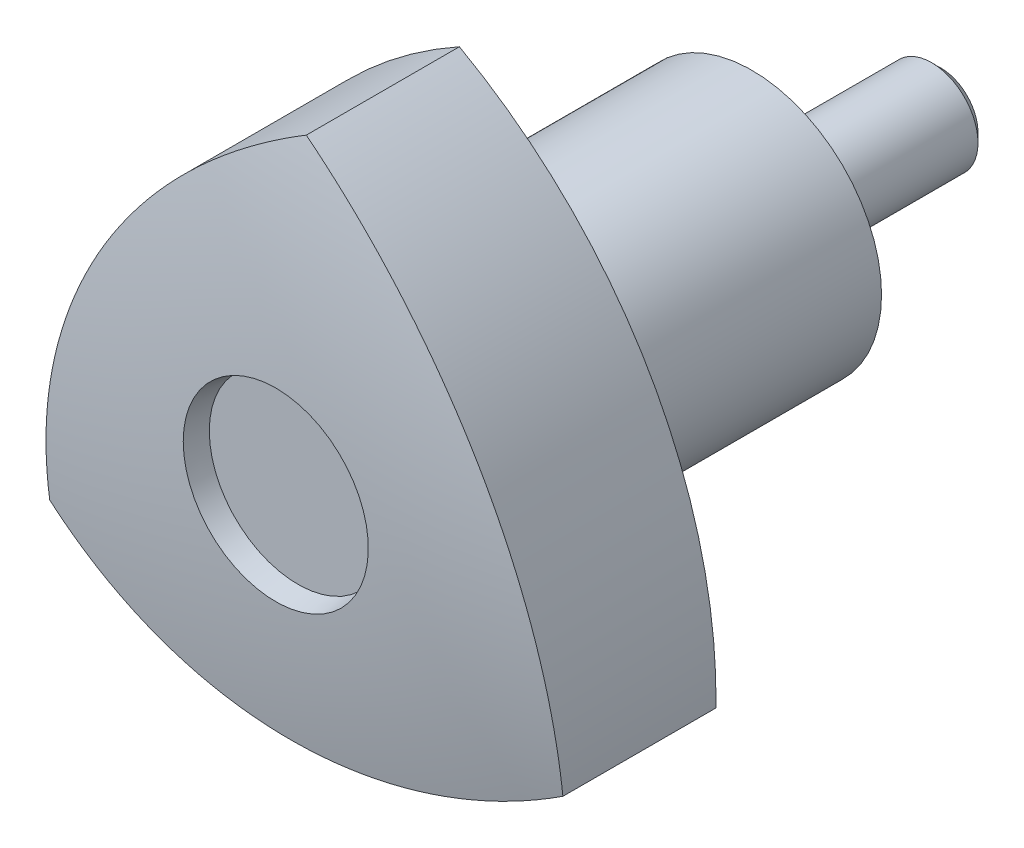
ISO-10303-21;
HEADER;
FILE_DESCRIPTION(('STEP AP214'),'2;1');
FILE_NAME('part.step','',(''),(''),'','','');
FILE_SCHEMA(('AUTOMOTIVE_DESIGN { 1 0 10303 214 1 1 1 1 }'));
ENDSEC;
DATA;
#1=APPLICATION_CONTEXT('core data for automotive mechanical design processes');
#2=APPLICATION_PROTOCOL_DEFINITION('international standard','automotive_design',2000,#1);
#3=PRODUCT_CONTEXT('',#1,'mechanical');
#4=PRODUCT('Part','Part','',(#3));
#5=PRODUCT_RELATED_PRODUCT_CATEGORY('part','',(#4));
#6=PRODUCT_DEFINITION_FORMATION('','',#4);
#7=PRODUCT_DEFINITION_CONTEXT('part definition',#1,'design');
#8=PRODUCT_DEFINITION('design','',#6,#7);
#9=PRODUCT_DEFINITION_SHAPE('','',#8);
#10=(LENGTH_UNIT() NAMED_UNIT(*) SI_UNIT(.MILLI.,.METRE.));
#11=(NAMED_UNIT(*) PLANE_ANGLE_UNIT() SI_UNIT($,.RADIAN.));
#12=(NAMED_UNIT(*) SI_UNIT($,.STERADIAN.) SOLID_ANGLE_UNIT());
#13=UNCERTAINTY_MEASURE_WITH_UNIT(LENGTH_MEASURE(1.E-05),#10,'distance_accuracy_value','');
#14=(GEOMETRIC_REPRESENTATION_CONTEXT(3) GLOBAL_UNCERTAINTY_ASSIGNED_CONTEXT((#13)) GLOBAL_UNIT_ASSIGNED_CONTEXT((#10,
#11,#12)) REPRESENTATION_CONTEXT('',''));
#15=CARTESIAN_POINT('',(0.,0.,0.));
#16=DIRECTION('',(0.,0.,1.));
#17=DIRECTION('',(1.,0.,0.));
#18=AXIS2_PLACEMENT_3D('',#15,#16,#17);
#19=CARTESIAN_POINT('',(0.,-3.25,16.));
#20=DIRECTION('',(0.,0.,-1.));
#21=DIRECTION('',(1.,0.,0.));
#22=AXIS2_PLACEMENT_3D('',#19,#20,#21);
#23=PLANE('',#22);
#24=CARTESIAN_POINT('',(0.,0.,16.0000000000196));
#25=DIRECTION('',(0.,0.,1.));
#26=DIRECTION('',(-1.,0.,0.));
#27=AXIS2_PLACEMENT_3D('',#24,#25,#26);
#28=CIRCLE('',#27,3.2499999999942);
#29=CARTESIAN_POINT('',(-3.2499999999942,0.,16.0000000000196));
#30=VERTEX_POINT('',#29);
#31=EDGE_CURVE('E19',#30,#30,#28,.T.);
#32=ORIENTED_EDGE('',*,*,#31,.T.);
#33=EDGE_LOOP('',(#32));
#34=FACE_BOUND('',#33,.T.);
#35=ADVANCED_FACE('F14',(#34),#23,.F.);
#36=CARTESIAN_POINT('',(0.,0.,23.8666666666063));
#37=DIRECTION('',(0.,0.,1.));
#38=DIRECTION('',(-1.,0.,0.));
#39=AXIS2_PLACEMENT_3D('',#36,#37,#38);
#40=CONICAL_SURFACE('',#39,4.63710558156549,0.174532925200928);
#41=CARTESIAN_POINT('',(0.,0.,23.8666666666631));
#42=DIRECTION('',(0.,0.,1.));
#43=DIRECTION('',(-1.,0.,0.));
#44=AXIS2_PLACEMENT_3D('',#41,#42,#43);
#45=CIRCLE('',#44,4.63710558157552);
#46=CARTESIAN_POINT('',(-4.63710558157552,0.,23.8666666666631));
#47=VERTEX_POINT('',#46);
#48=EDGE_CURVE('E138',#47,#47,#45,.T.);
#49=ORIENTED_EDGE('',*,*,#48,.T.);
#50=EDGE_LOOP('',(#49));
#51=FACE_BOUND('',#50,.T.);
#52=ORIENTED_EDGE('',*,*,#31,.F.);
#53=EDGE_LOOP('',(#52));
#54=FACE_BOUND('',#53,.T.);
#55=ADVANCED_FACE('F146',(#51,#54),#40,.F.);
#56=CARTESIAN_POINT('',(0.,-0.000999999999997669,23.8666666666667));
#57=DIRECTION('',(0.,0.,1.));
#58=DIRECTION('',(-1.,0.,0.));
#59=AXIS2_PLACEMENT_3D('',#56,#57,#58);
#60=PLANE('',#59);
#61=CARTESIAN_POINT('',(0.,0.,23.8666666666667));
#62=DIRECTION('',(0.,0.,-1.));
#63=DIRECTION('',(1.,0.,0.));
#64=AXIS2_PLACEMENT_3D('',#61,#62,#63);
#65=CIRCLE('',#64,0.0009999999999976);
#66=CARTESIAN_POINT('',(0.0009999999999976,0.,23.8666666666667));
#67=VERTEX_POINT('',#66);
#68=EDGE_CURVE('E136',#67,#67,#65,.F.);
#69=ORIENTED_EDGE('',*,*,#68,.T.);
#70=EDGE_LOOP('',(#69));
#71=FACE_BOUND('',#70,.T.);
#72=ORIENTED_EDGE('',*,*,#48,.F.);
#73=EDGE_LOOP('',(#72));
#74=FACE_BOUND('',#73,.T.);
#75=ADVANCED_FACE('F148',(#71,#74),#60,.F.);
#76=CARTESIAN_POINT('',(0.,0.,16.));
#77=DIRECTION('',(0.,0.,-1.));
#78=DIRECTION('',(1.,0.,0.));
#79=AXIS2_PLACEMENT_3D('',#76,#77,#78);
#80=CYLINDRICAL_SURFACE('',#79,0.0009999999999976);
#81=CARTESIAN_POINT('',(0.,0.,24.72));
#82=DIRECTION('',(0.,0.,-1.));
#83=DIRECTION('',(1.,0.,0.));
#84=AXIS2_PLACEMENT_3D('',#81,#82,#83);
#85=CIRCLE('',#84,0.0009999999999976);
#86=CARTESIAN_POINT('',(0.0009999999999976,0.,24.72));
#87=VERTEX_POINT('',#86);
#88=EDGE_CURVE('E133',#87,#87,#85,.F.);
#89=ORIENTED_EDGE('',*,*,#88,.T.);
#90=EDGE_LOOP('',(#89));
#91=FACE_BOUND('',#90,.T.);
#92=ORIENTED_EDGE('',*,*,#68,.F.);
#93=EDGE_LOOP('',(#92));
#94=FACE_BOUND('',#93,.T.);
#95=ADVANCED_FACE('F155',(#91,#94),#80,.F.);
#96=CARTESIAN_POINT('',(0.,0.,-10.));
#97=DIRECTION('',(0.,0.,1.));
#98=DIRECTION('',(-1.,0.,0.));
#99=AXIS2_PLACEMENT_3D('',#96,#97,#98);
#100=PLANE('',#99);
#101=CARTESIAN_POINT('',(0.,0.,-9.99999999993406));
#102=DIRECTION('',(0.,0.,1.));
#103=DIRECTION('',(-1.,0.,0.));
#104=AXIS2_PLACEMENT_3D('',#101,#102,#103);
#105=CIRCLE('',#104,2.00949999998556);
#106=CARTESIAN_POINT('',(-2.00949999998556,0.,-9.99999999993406));
#107=VERTEX_POINT('',#106);
#108=EDGE_CURVE('E130',#107,#107,#105,.T.);
#109=ORIENTED_EDGE('',*,*,#108,.F.);
#110=EDGE_LOOP('',(#109));
#111=FACE_BOUND('',#110,.T.);
#112=ADVANCED_FACE('F211',(#111),#100,.F.);
#113=CARTESIAN_POINT('',(0.,-4.78757127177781,24.72));
#114=DIRECTION('',(0.,0.,-1.));
#115=DIRECTION('',(1.,0.,0.));
#116=AXIS2_PLACEMENT_3D('',#113,#114,#115);
#117=PLANE('',#116);
#118=CARTESIAN_POINT('',(0.,0.,24.7200000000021));
#119=DIRECTION('',(0.,0.,1.));
#120=DIRECTION('',(-1.,0.,0.));
#121=AXIS2_PLACEMENT_3D('',#118,#119,#120);
#122=CIRCLE('',#121,4.78757127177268);
#123=CARTESIAN_POINT('',(-4.78757127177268,0.,24.7200000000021));
#124=VERTEX_POINT('',#123);
#125=EDGE_CURVE('E82',#124,#124,#122,.T.);
#126=ORIENTED_EDGE('',*,*,#125,.T.);
#127=EDGE_LOOP('',(#126));
#128=FACE_BOUND('',#127,.T.);
#129=ORIENTED_EDGE('',*,*,#88,.F.);
#130=EDGE_LOOP('',(#129));
#131=FACE_BOUND('',#130,.T.);
#132=ADVANCED_FACE('F207',(#128,#131),#117,.F.);
#133=CARTESIAN_POINT('',(0.,0.,-9.50950000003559));
#134=DIRECTION('',(0.,0.,1.));
#135=DIRECTION('',(-1.,0.,0.));
#136=AXIS2_PLACEMENT_3D('',#133,#134,#135);
#137=CONICAL_SURFACE('',#136,2.49999999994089,0.785398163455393);
#138=ORIENTED_EDGE('',*,*,#108,.T.);
#139=EDGE_LOOP('',(#138));
#140=FACE_BOUND('',#139,.T.);
#141=CARTESIAN_POINT('',(0.,0.,-9.5095));
#142=DIRECTION('',(0.,0.,-1.));
#143=DIRECTION('',(1.,0.,0.));
#144=AXIS2_PLACEMENT_3D('',#141,#142,#143);
#145=CIRCLE('',#144,2.5);
#146=CARTESIAN_POINT('',(2.5,0.,-9.5095));
#147=VERTEX_POINT('',#146);
#148=EDGE_CURVE('E77',#147,#147,#145,.F.);
#149=ORIENTED_EDGE('',*,*,#148,.F.);
#150=EDGE_LOOP('',(#149));
#151=FACE_BOUND('',#150,.T.);
#152=ADVANCED_FACE('F201',(#140,#151),#137,.T.);
#153=CARTESIAN_POINT('',(0.,0.,25.9170998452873));
#154=DIRECTION('',(0.,0.,1.));
#155=DIRECTION('',(-1.,0.,0.));
#156=AXIS2_PLACEMENT_3D('',#153,#154,#155);
#157=CONICAL_SURFACE('',#156,4.99865227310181,0.174532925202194);
#158=CARTESIAN_POINT('',(0.,0.,25.917099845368));
#159=DIRECTION('',(0.,0.,-1.));
#160=DIRECTION('',(0.,1.,0.));
#161=AXIS2_PLACEMENT_3D('',#158,#159,#160);
#162=CIRCLE('',#161,4.9986522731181);
#163=CARTESIAN_POINT('',(0.,4.9986522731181,25.917099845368));
#164=VERTEX_POINT('',#163);
#165=EDGE_CURVE('E74',#164,#164,#162,.T.);
#166=ORIENTED_EDGE('',*,*,#165,.F.);
#167=EDGE_LOOP('',(#166));
#168=FACE_BOUND('',#167,.T.);
#169=ORIENTED_EDGE('',*,*,#125,.F.);
#170=EDGE_LOOP('',(#169));
#171=FACE_BOUND('',#170,.T.);
#172=ADVANCED_FACE('F196',(#168,#171),#157,.F.);
#173=CARTESIAN_POINT('',(0.,0.,16.));
#174=DIRECTION('',(0.,0.,-1.));
#175=DIRECTION('',(1.,0.,0.));
#176=AXIS2_PLACEMENT_3D('',#173,#174,#175);
#177=CYLINDRICAL_SURFACE('',#176,2.5);
#178=ORIENTED_EDGE('',*,*,#148,.T.);
#179=EDGE_LOOP('',(#178));
#180=FACE_BOUND('',#179,.T.);
#181=CARTESIAN_POINT('',(0.,0.,0.));
#182=DIRECTION('',(0.,0.,-1.));
#183=DIRECTION('',(1.,0.,0.));
#184=AXIS2_PLACEMENT_3D('',#181,#182,#183);
#185=CIRCLE('',#184,2.5);
#186=CARTESIAN_POINT('',(2.5,0.,0.));
#187=VERTEX_POINT('',#186);
#188=EDGE_CURVE('E59',#187,#187,#185,.T.);
#189=ORIENTED_EDGE('',*,*,#188,.T.);
#190=EDGE_LOOP('',(#189));
#191=FACE_BOUND('',#190,.T.);
#192=ADVANCED_FACE('F191',(#180,#191),#177,.T.);
#193=CARTESIAN_POINT('',(0.,0.,-34.969444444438));
#194=DIRECTION('',(0.,0.,1.));
#195=DIRECTION('',(0.,-1.,0.));
#196=AXIS2_PLACEMENT_3D('',#193,#194,#195);
#197=DEGENERATE_TOROIDAL_SURFACE('',#196,1.4888657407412,60.987620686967,.T.);
#198=ORIENTED_EDGE('',*,*,#165,.T.);
#199=EDGE_LOOP('',(#198));
#200=FACE_BOUND('',#199,.T.);
#201=CARTESIAN_POINT('',(0.,16.,24.2666666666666));
#202=CARTESIAN_POINT('',(0.298468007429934,15.8344141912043,24.3072305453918));
#203=CARTESIAN_POINT('',(0.593899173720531,15.6630883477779,24.3464180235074));
#204=CARTESIAN_POINT('',(1.17828931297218,15.3091538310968,24.4220135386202));
#205=CARTESIAN_POINT('',(1.4672482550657,15.126545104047,24.4584215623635));
#206=CARTESIAN_POINT('',(2.32368013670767,14.5621816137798,24.5634194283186));
#207=CARTESIAN_POINT('',(2.88084921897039,14.1638112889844,24.6278022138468));
#208=CARTESIAN_POINT('',(3.9638795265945,13.3251525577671,24.745116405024));
#209=CARTESIAN_POINT('',(4.48974088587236,12.8848643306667,24.7980478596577));
#210=CARTESIAN_POINT('',(5.50690924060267,11.964847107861,24.8923618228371));
#211=CARTESIAN_POINT('',(5.9982148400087,11.4851165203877,24.9337438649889));
#212=CARTESIAN_POINT('',(6.98285633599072,10.4471495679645,25.007906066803));
#213=CARTESIAN_POINT('',(7.47289244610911,9.88570379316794,25.0396709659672));
#214=CARTESIAN_POINT('',(8.40500958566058,8.72373702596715,25.0895862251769));
#215=CARTESIAN_POINT('',(8.84708705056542,8.12321313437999,25.1077355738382));
#216=CARTESIAN_POINT('',(9.6801106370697,6.88720904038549,25.1304492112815));
#217=CARTESIAN_POINT('',(10.0710498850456,6.25172415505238,25.1350116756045));
#218=CARTESIAN_POINT('',(10.6167727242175,5.27607530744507,25.1316729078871));
#219=CARTESIAN_POINT('',(10.7919029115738,4.94711423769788,25.1288627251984));
#220=CARTESIAN_POINT('',(11.1283886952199,4.28215813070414,25.1198463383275));
#221=CARTESIAN_POINT('',(11.2897407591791,3.94616131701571,25.1136392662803));
#222=CARTESIAN_POINT('',(11.750377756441,2.93355634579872,25.0900304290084));
#223=CARTESIAN_POINT('',(12.0289414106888,2.24750521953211,25.0676243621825));
#224=CARTESIAN_POINT('',(12.5284636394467,0.855302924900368,25.0093712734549));
#225=CARTESIAN_POINT('',(12.7494224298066,0.149151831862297,24.9735243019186));
#226=CARTESIAN_POINT('',(13.0365040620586,-0.920875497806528,24.9097113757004));
#227=CARTESIAN_POINT('',(13.1247838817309,-1.27923423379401,24.8867756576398));
#228=CARTESIAN_POINT('',(13.2864817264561,-1.9989639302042,24.837568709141));
#229=CARTESIAN_POINT('',(13.3599033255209,-2.36033414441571,24.8112982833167));
#230=CARTESIAN_POINT('',(13.5576933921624,-3.44789900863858,24.7275082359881));
#231=CARTESIAN_POINT('',(13.6596925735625,-4.17794132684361,24.6649864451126));
#232=CARTESIAN_POINT('',(13.7820705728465,-5.42455627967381,24.5473880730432));
#233=CARTESIAN_POINT('',(13.8177034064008,-5.94002787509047,24.4956294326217));
#234=CARTESIAN_POINT('',(13.859244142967,-6.97051741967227,24.3858387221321));
#235=CARTESIAN_POINT('',(13.8652079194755,-7.48553439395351,24.3278186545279));
#236=CARTESIAN_POINT('',(13.8564064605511,-8.00000000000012,24.2666666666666));
#237=B_SPLINE_CURVE_WITH_KNOTS('',3,(#201,#202,#203,#204,#205,#206,#207,#208,#209,#210,#211,
#212,#213,#214,#215,#216,#217,#218,#219,#220,#221,#222,#223,#224,#225,#226,#227,#228,#229,#230,
#231,#232,#233,#234,#235,#236),.UNSPECIFIED.,.F.,.F.,(4,2,2,2,2,2,2,2,2,2,2,2,2,2,2,2,2,4),(0.,
1.03104347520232,2.06209186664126,4.12370256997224,6.18530445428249,8.24698957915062,
10.481950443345,12.7170773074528,14.9525042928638,16.0702694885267,17.1883203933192,
19.407883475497,21.627438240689,22.7365014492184,23.845297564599,26.0616695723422,
27.6187214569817,29.1728399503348),.UNSPECIFIED.);
#238=CARTESIAN_POINT('',(0.,16.,24.2666666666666));
#239=VERTEX_POINT('',#238);
#240=CARTESIAN_POINT('',(13.856406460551,-8.00000000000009,24.2666666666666));
#241=VERTEX_POINT('',#240);
#242=EDGE_CURVE('E49',#239,#241,#237,.T.);
#243=ORIENTED_EDGE('',*,*,#242,.F.);
#244=CARTESIAN_POINT('',(-13.8564064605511,-7.99999999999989,24.2666666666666));
#245=CARTESIAN_POINT('',(-13.8622389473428,-7.6587262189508,24.3072305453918));
#246=CARTESIAN_POINT('',(-13.861581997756,-7.31721240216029,24.3464180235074));
#247=CARTESIAN_POINT('',(-13.8472607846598,-6.63414843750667,24.4220135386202));
#248=CARTESIAN_POINT('',(-13.8335964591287,-6.29259828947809,24.4584215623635));
#249=CARTESIAN_POINT('',(-13.7730592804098,-5.26872477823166,24.5634194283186));
#250=CARTESIAN_POINT('',(-13.7066450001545,-4.5870170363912,24.6278022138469));
#251=CARTESIAN_POINT('',(-13.5218603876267,-3.22975591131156,24.745116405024));
#252=CARTESIAN_POINT('',(-13.4034902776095,-2.55420250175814,24.7980478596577));
#253=CARTESIAN_POINT('',(-13.1153161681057,-1.21330025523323,24.8923618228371));
#254=CARTESIAN_POINT('',(-12.9455100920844,-0.547951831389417,24.9337438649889));
#255=CARTESIAN_POINT('',(-12.5389250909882,0.823756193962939,25.007906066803));
#256=CARTESIAN_POINT('',(-12.2977168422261,1.52886280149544,25.0396709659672));
#257=CARTESIAN_POINT('',(-11.7574826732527,2.91708330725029,25.0895862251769));
#258=CARTESIAN_POINT('',(-11.4584524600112,3.60019556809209,25.1077355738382));
#259=CARTESIAN_POINT('',(-10.8045533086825,4.93961720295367,25.1304492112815));
#260=CARTESIAN_POINT('',(-10.4496768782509,5.59592296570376,25.1350116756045));
#261=CARTESIAN_POINT('',(-9.87760161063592,6.55635723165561,25.1316729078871));
#262=CARTESIAN_POINT('',(-9.6802780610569,6.87250495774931,25.1288627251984));
#263=CARTESIAN_POINT('',(-9.27265207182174,7.49638824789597,25.1198463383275));
#264=CARTESIAN_POINT('',(-9.06234632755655,7.80412164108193,25.1136392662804));
#265=CARTESIAN_POINT('',(-8.41572319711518,8.70934746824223,25.0900304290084));
#266=CARTESIAN_POINT('',(-7.96086732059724,9.29361623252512,25.0676243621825));
#267=CARTESIAN_POINT('',(-7.00494588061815,10.4223163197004,25.0093712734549));
#268=CARTESIAN_POINT('',(-6.50388049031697,10.9667477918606,24.9735243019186));
#269=CARTESIAN_POINT('',(-5.7207504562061,11.7503814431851,24.9097113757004));
#270=CARTESIAN_POINT('',(-5.45454259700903,12.0060133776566,24.8867756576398));
#271=CARTESIAN_POINT('',(-4.91208731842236,12.5059126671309,24.837568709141));
#272=CARTESIAN_POINT('',(-4.63584233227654,12.7501827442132,24.8112982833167));
#273=CARTESIAN_POINT('',(-3.79287856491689,13.4652563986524,24.7275082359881));
#274=CARTESIAN_POINT('',(-3.21164296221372,13.9186114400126,24.6649864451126));
#275=CARTESIAN_POINT('',(-2.19323174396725,14.6479013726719,24.5473880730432));
#276=CARTESIAN_POINT('',(-1.76463666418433,14.9364961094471,24.4956294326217));
#277=CARTESIAN_POINT('',(-0.892976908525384,15.4877162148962,24.3858387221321));
#278=CARTESIAN_POINT('',(-0.44994101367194,15.7503894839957,24.3278186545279));
#279=CARTESIAN_POINT('',(0.,16.,24.2666666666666));
#280=B_SPLINE_CURVE_WITH_KNOTS('',3,(#244,#245,#246,#247,#248,#249,#250,#251,#252,#253,#254,
#255,#256,#257,#258,#259,#260,#261,#262,#263,#264,#265,#266,#267,#268,#269,#270,#271,#272,#273,
#274,#275,#276,#277,#278,#279),.UNSPECIFIED.,.F.,.F.,(4,2,2,2,2,2,2,2,2,2,2,2,2,2,2,2,2,4),(0.,
1.03104347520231,2.06209186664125,4.12370256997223,6.18530445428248,8.24698957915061,
10.481950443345,12.7170773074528,14.9525042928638,16.0702694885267,17.1883203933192,
19.407883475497,21.627438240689,22.7365014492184,23.845297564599,26.0616695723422,
27.6187214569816,29.1728399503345),.UNSPECIFIED.);
#281=CARTESIAN_POINT('',(-13.8564064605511,-8.,24.2666666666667));
#282=VERTEX_POINT('',#281);
#283=EDGE_CURVE('E58',#282,#239,#280,.T.);
#284=ORIENTED_EDGE('',*,*,#283,.F.);
#285=CARTESIAN_POINT('',(13.8564064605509,-8.,24.2666666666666));
#286=CARTESIAN_POINT('',(13.5637709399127,-8.17568797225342,24.3072305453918));
#287=CARTESIAN_POINT('',(13.2676828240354,-8.34587594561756,24.3464180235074));
#288=CARTESIAN_POINT('',(12.6689714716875,-8.67500539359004,24.4220135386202));
#289=CARTESIAN_POINT('',(12.3663482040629,-8.83394681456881,24.4584215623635));
#290=CARTESIAN_POINT('',(11.4493791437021,-9.29345683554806,24.5634194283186));
#291=CARTESIAN_POINT('',(10.8257957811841,-9.57679425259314,24.6278022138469));
#292=CARTESIAN_POINT('',(9.55798086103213,-10.0953966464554,24.745116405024));
#293=CARTESIAN_POINT('',(8.91374939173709,-10.3306618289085,24.7980478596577));
#294=CARTESIAN_POINT('',(7.60840692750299,-10.7515468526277,24.8923618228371));
#295=CARTESIAN_POINT('',(6.94729525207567,-10.9371646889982,24.9337438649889));
#296=CARTESIAN_POINT('',(5.55606875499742,-11.2709057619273,25.007906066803));
#297=CARTESIAN_POINT('',(4.82482439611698,-11.4145665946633,25.0396709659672));
#298=CARTESIAN_POINT('',(3.35247308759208,-11.6408203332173,25.0895862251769));
#299=CARTESIAN_POINT('',(2.61136540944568,-11.723408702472,25.1077355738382));
#300=CARTESIAN_POINT('',(1.12444267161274,-11.826826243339,25.1304492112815));
#301=CARTESIAN_POINT('',(0.378626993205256,-11.847647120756,25.1350116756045));
#302=CARTESIAN_POINT('',(-0.73917111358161,-11.8324325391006,25.1316729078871));
#303=CARTESIAN_POINT('',(-1.11162485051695,-11.8196191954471,25.1288627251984));
#304=CARTESIAN_POINT('',(-1.85573662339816,-11.7785463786,25.1198463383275));
#305=CARTESIAN_POINT('',(-2.22739443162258,-11.7502829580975,25.1136392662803));
#306=CARTESIAN_POINT('',(-3.33465455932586,-11.6429038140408,25.0900304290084));
#307=CARTESIAN_POINT('',(-4.06807409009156,-11.5411214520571,25.0676243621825));
#308=CARTESIAN_POINT('',(-5.52351775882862,-11.2776192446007,25.0093712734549));
#309=CARTESIAN_POINT('',(-6.24554193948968,-11.1158996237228,24.9735243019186));
#310=CARTESIAN_POINT('',(-7.31575360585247,-10.8295059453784,24.9097113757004));
#311=CARTESIAN_POINT('',(-7.67024128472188,-10.7267791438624,24.8867756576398));
#312=CARTESIAN_POINT('',(-8.37439440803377,-10.5069487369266,24.837568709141));
#313=CARTESIAN_POINT('',(-8.72406099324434,-10.3898485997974,24.8112982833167));
#314=CARTESIAN_POINT('',(-9.76481482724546,-10.0173573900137,24.727508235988));
#315=CARTESIAN_POINT('',(-10.4480496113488,-9.74067011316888,24.6649864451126));
#316=CARTESIAN_POINT('',(-11.5888388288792,-9.22334509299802,24.5473880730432));
#317=CARTESIAN_POINT('',(-12.0530667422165,-8.99646823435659,24.4956294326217));
#318=CARTESIAN_POINT('',(-12.9662672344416,-8.51719879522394,24.3858387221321));
#319=CARTESIAN_POINT('',(-13.4152669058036,-8.26485509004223,24.3278186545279));
#320=CARTESIAN_POINT('',(-13.8564064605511,-8.,24.2666666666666));
#321=B_SPLINE_CURVE_WITH_KNOTS('',3,(#285,#286,#287,#288,#289,#290,#291,#292,#293,#294,#295,
#296,#297,#298,#299,#300,#301,#302,#303,#304,#305,#306,#307,#308,#309,#310,#311,#312,#313,#314,
#315,#316,#317,#318,#319,#320),.UNSPECIFIED.,.F.,.F.,(4,2,2,2,2,2,2,2,2,2,2,2,2,2,2,2,2,4),(0.,
1.03104347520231,2.06209186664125,4.12370256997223,6.18530445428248,8.24698957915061,
10.481950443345,12.7170773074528,14.9525042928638,16.0702694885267,17.1883203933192,
19.407883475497,21.627438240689,22.7365014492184,23.845297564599,26.0616695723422,
27.6187214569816,29.1728399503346),.UNSPECIFIED.);
#322=EDGE_CURVE('E62',#241,#282,#321,.T.);
#323=ORIENTED_EDGE('',*,*,#322,.F.);
#324=EDGE_LOOP('',(#243,#284,#323));
#325=FACE_BOUND('',#324,.T.);
#326=ADVANCED_FACE('F16',(#200,#325),#197,.T.);
#327=CARTESIAN_POINT('',(0.,-2.5,0.));
#328=DIRECTION('',(0.,0.,1.));
#329=DIRECTION('',(-1.,0.,0.));
#330=AXIS2_PLACEMENT_3D('',#327,#328,#329);
#331=PLANE('',#330);
#332=ORIENTED_EDGE('',*,*,#188,.F.);
#333=EDGE_LOOP('',(#332));
#334=FACE_BOUND('',#333,.T.);
#335=CARTESIAN_POINT('',(0.,0.,0.));
#336=DIRECTION('',(0.,0.,-1.));
#337=DIRECTION('',(1.,0.,0.));
#338=AXIS2_PLACEMENT_3D('',#335,#336,#337);
#339=CIRCLE('',#338,3.25);
#340=CARTESIAN_POINT('',(3.25,0.,0.));
#341=VERTEX_POINT('',#340);
#342=EDGE_CURVE('E94',#341,#341,#339,.F.);
#343=ORIENTED_EDGE('',*,*,#342,.F.);
#344=EDGE_LOOP('',(#343));
#345=FACE_BOUND('',#344,.T.);
#346=ADVANCED_FACE('F119',(#334,#345),#331,.F.);
#347=CARTESIAN_POINT('',(-13.0596630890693,-7.54,32.));
#348=DIRECTION('',(0.,0.,1.));
#349=DIRECTION('',(-1.,0.,0.));
#350=AXIS2_PLACEMENT_3D('',#347,#348,#349);
#351=CYLINDRICAL_SURFACE('',#350,26.92);
#352=DIRECTION('',(0.,0.,1.));
#353=VECTOR('',#352,1.);
#354=CARTESIAN_POINT('',(13.856406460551,-8.,32.));
#355=LINE('',#354,#353);
#356=CARTESIAN_POINT('',(13.856406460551,-8.,16.));
#357=VERTEX_POINT('',#356);
#358=EDGE_CURVE('E54',#357,#241,#355,.T.);
#359=ORIENTED_EDGE('',*,*,#358,.F.);
#360=CARTESIAN_POINT('',(-13.0596630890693,-7.54,16.));
#361=DIRECTION('',(0.,0.,1.));
#362=DIRECTION('',(-1.,0.,0.));
#363=AXIS2_PLACEMENT_3D('',#360,#361,#362);
#364=CIRCLE('',#363,26.92);
#365=CARTESIAN_POINT('',(0.,16.,16.));
#366=VERTEX_POINT('',#365);
#367=EDGE_CURVE('E92',#357,#366,#364,.T.);
#368=ORIENTED_EDGE('',*,*,#367,.T.);
#369=DIRECTION('',(0.,0.,1.));
#370=VECTOR('',#369,1.);
#371=CARTESIAN_POINT('',(0.,16.,32.));
#372=LINE('',#371,#370);
#373=EDGE_CURVE('E56',#239,#366,#372,.F.);
#374=ORIENTED_EDGE('',*,*,#373,.F.);
#375=ORIENTED_EDGE('',*,*,#242,.T.);
#376=EDGE_LOOP('',(#359,#368,#374,#375));
#377=FACE_BOUND('',#376,.T.);
#378=ADVANCED_FACE('F52',(#377),#351,.T.);
#379=CARTESIAN_POINT('',(13.0596630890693,-7.54,32.));
#380=DIRECTION('',(0.,0.,1.));
#381=DIRECTION('',(-1.,0.,0.));
#382=AXIS2_PLACEMENT_3D('',#379,#380,#381);
#383=CYLINDRICAL_SURFACE('',#382,26.92);
#384=ORIENTED_EDGE('',*,*,#373,.T.);
#385=CARTESIAN_POINT('',(13.0596630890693,-7.54,16.));
#386=DIRECTION('',(0.,0.,1.));
#387=DIRECTION('',(-1.,0.,0.));
#388=AXIS2_PLACEMENT_3D('',#385,#386,#387);
#389=CIRCLE('',#388,26.92);
#390=CARTESIAN_POINT('',(-13.8564064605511,-8.,16.));
#391=VERTEX_POINT('',#390);
#392=EDGE_CURVE('E34',#366,#391,#389,.T.);
#393=ORIENTED_EDGE('',*,*,#392,.T.);
#394=DIRECTION('',(0.,0.,1.));
#395=VECTOR('',#394,1.);
#396=CARTESIAN_POINT('',(-13.8564064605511,-8.,32.));
#397=LINE('',#396,#395);
#398=EDGE_CURVE('E64',#282,#391,#397,.F.);
#399=ORIENTED_EDGE('',*,*,#398,.F.);
#400=ORIENTED_EDGE('',*,*,#283,.T.);
#401=EDGE_LOOP('',(#384,#393,#399,#400));
#402=FACE_BOUND('',#401,.T.);
#403=ADVANCED_FACE('F111',(#402),#383,.T.);
#404=CARTESIAN_POINT('',(0.,15.08,32.));
#405=DIRECTION('',(0.,0.,1.));
#406=DIRECTION('',(-1.,0.,0.));
#407=AXIS2_PLACEMENT_3D('',#404,#405,#406);
#408=CYLINDRICAL_SURFACE('',#407,26.92);
#409=ORIENTED_EDGE('',*,*,#398,.T.);
#410=CARTESIAN_POINT('',(0.,15.08,16.));
#411=DIRECTION('',(0.,0.,1.));
#412=DIRECTION('',(-1.,0.,0.));
#413=AXIS2_PLACEMENT_3D('',#410,#411,#412);
#414=CIRCLE('',#413,26.92);
#415=EDGE_CURVE('E68',#391,#357,#414,.T.);
#416=ORIENTED_EDGE('',*,*,#415,.T.);
#417=ORIENTED_EDGE('',*,*,#358,.T.);
#418=ORIENTED_EDGE('',*,*,#322,.T.);
#419=EDGE_LOOP('',(#409,#416,#417,#418));
#420=FACE_BOUND('',#419,.T.);
#421=ADVANCED_FACE('F66',(#420),#408,.T.);
#422=CARTESIAN_POINT('',(0.,0.,16.));
#423=DIRECTION('',(0.,0.,-1.));
#424=DIRECTION('',(1.,0.,0.));
#425=AXIS2_PLACEMENT_3D('',#422,#423,#424);
#426=CYLINDRICAL_SURFACE('',#425,3.25);
#427=ORIENTED_EDGE('',*,*,#342,.T.);
#428=EDGE_LOOP('',(#427));
#429=FACE_BOUND('',#428,.T.);
#430=CARTESIAN_POINT('',(0.,0.,0.199999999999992));
#431=DIRECTION('',(0.,0.,-1.));
#432=DIRECTION('',(1.,0.,0.));
#433=AXIS2_PLACEMENT_3D('',#430,#431,#432);
#434=CIRCLE('',#433,3.25);
#435=CARTESIAN_POINT('',(3.25,0.,0.199999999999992));
#436=VERTEX_POINT('',#435);
#437=EDGE_CURVE('E87',#436,#436,#434,.T.);
#438=ORIENTED_EDGE('',*,*,#437,.T.);
#439=EDGE_LOOP('',(#438));
#440=FACE_BOUND('',#439,.T.);
#441=ADVANCED_FACE('F110',(#429,#440),#426,.T.);
#442=CARTESIAN_POINT('',(0.,-7.,16.));
#443=DIRECTION('',(0.,0.,1.));
#444=DIRECTION('',(-1.,0.,0.));
#445=AXIS2_PLACEMENT_3D('',#442,#443,#444);
#446=PLANE('',#445);
#447=CARTESIAN_POINT('',(0.,0.,16.));
#448=DIRECTION('',(0.,0.,-1.));
#449=DIRECTION('',(1.,0.,0.));
#450=AXIS2_PLACEMENT_3D('',#447,#448,#449);
#451=CIRCLE('',#450,7.);
#452=CARTESIAN_POINT('',(7.,0.,16.));
#453=VERTEX_POINT('',#452);
#454=EDGE_CURVE('E25',#453,#453,#451,.T.);
#455=ORIENTED_EDGE('',*,*,#454,.F.);
#456=EDGE_LOOP('',(#455));
#457=FACE_BOUND('',#456,.T.);
#458=ORIENTED_EDGE('',*,*,#392,.F.);
#459=ORIENTED_EDGE('',*,*,#367,.F.);
#460=ORIENTED_EDGE('',*,*,#415,.F.);
#461=EDGE_LOOP('',(#458,#459,#460));
#462=FACE_BOUND('',#461,.T.);
#463=ADVANCED_FACE('F166',(#457,#462),#446,.F.);
#464=CARTESIAN_POINT('',(0.,-3.25,0.199999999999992));
#465=DIRECTION('',(0.,0.,1.));
#466=DIRECTION('',(-1.,0.,0.));
#467=AXIS2_PLACEMENT_3D('',#464,#465,#466);
#468=PLANE('',#467);
#469=ORIENTED_EDGE('',*,*,#437,.F.);
#470=EDGE_LOOP('',(#469));
#471=FACE_BOUND('',#470,.T.);
#472=CARTESIAN_POINT('',(0.,0.,0.199999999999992));
#473=DIRECTION('',(0.,0.,-1.));
#474=DIRECTION('',(1.,0.,0.));
#475=AXIS2_PLACEMENT_3D('',#472,#473,#474);
#476=CIRCLE('',#475,7.);
#477=CARTESIAN_POINT('',(7.,0.,0.199999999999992));
#478=VERTEX_POINT('',#477);
#479=EDGE_CURVE('E9',#478,#478,#476,.F.);
#480=ORIENTED_EDGE('',*,*,#479,.F.);
#481=EDGE_LOOP('',(#480));
#482=FACE_BOUND('',#481,.T.);
#483=ADVANCED_FACE('F160',(#471,#482),#468,.F.);
#484=CARTESIAN_POINT('',(0.,0.,16.));
#485=DIRECTION('',(0.,0.,-1.));
#486=DIRECTION('',(1.,0.,0.));
#487=AXIS2_PLACEMENT_3D('',#484,#485,#486);
#488=CYLINDRICAL_SURFACE('',#487,7.);
#489=ORIENTED_EDGE('',*,*,#479,.T.);
#490=EDGE_LOOP('',(#489));
#491=FACE_BOUND('',#490,.T.);
#492=ORIENTED_EDGE('',*,*,#454,.T.);
#493=EDGE_LOOP('',(#492));
#494=FACE_BOUND('',#493,.T.);
#495=ADVANCED_FACE('F158',(#491,#494),#488,.T.);
#496=CLOSED_SHELL('',(#35,#55,#75,#95,#112,#132,#152,#172,#192,#326,#346,#378,#403,#421,#441,
#463,#483,#495));
#497=MANIFOLD_SOLID_BREP('B1',#496);
#498=ADVANCED_BREP_SHAPE_REPRESENTATION('',(#18,#497),#14);
#499=SHAPE_DEFINITION_REPRESENTATION(#9,#498);
ENDSEC;
END-ISO-10303-21;
